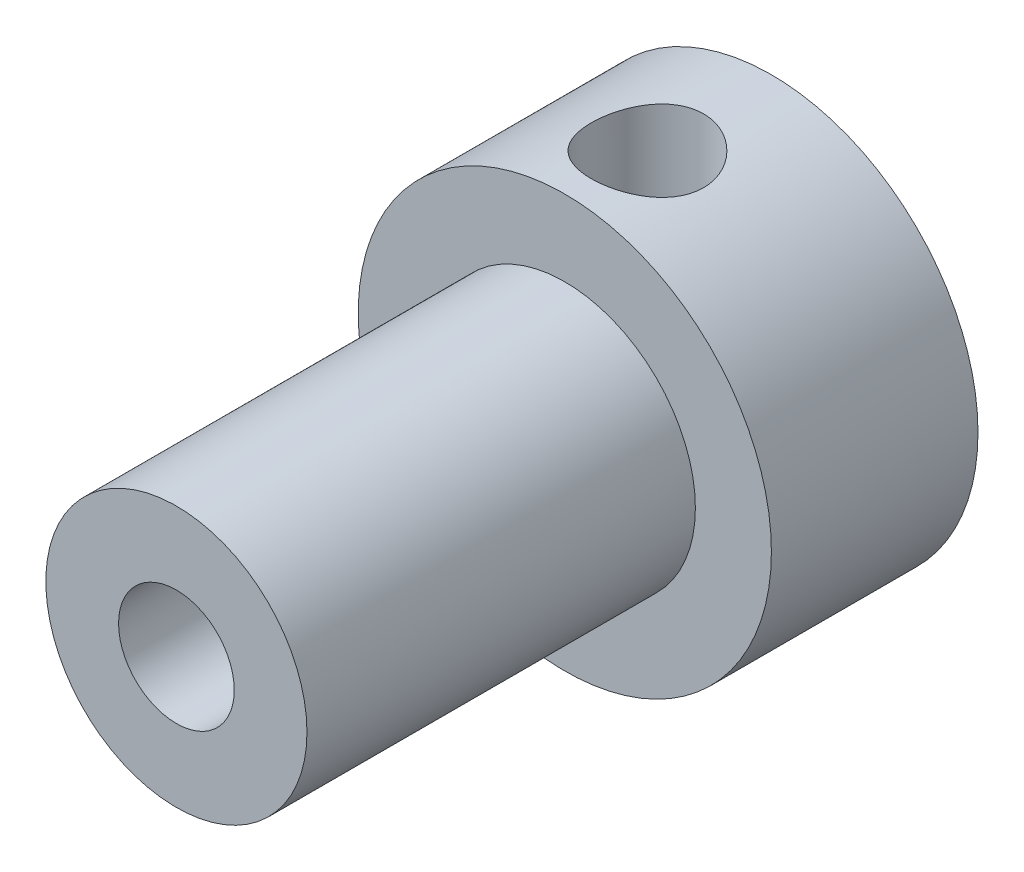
from build123d import *

# Parameters (mm, degrees)
SKETCH1_R                  = 6.35
SKETCH1_R_2                = 1.778
EXTRUDE1_DEPTH             = 18.288
EXTRUDE2_START             = -11.938
SKETCH2_R                  = 6.35
SKETCH2_R_2                = 4.0132
EXTRUDE2_DEPTH             = 11.938
F_8_32_TAPPED_HOLE1_REACH  = 22.279
F_8_32_TAPPED_HOLE1_BORE_R = 1.7272
SKETCH4_R                  = 2.00025
EXTRUDE3_DEPTH             = 10.668


with BuildPart() as part:
    # Sketch1 → Extrude1 (new body)
    with BuildSketch(Plane.XY):
        Circle(SKETCH1_R)
        Circle(SKETCH1_R_2, mode=Mode.SUBTRACT)
    extrude(amount=EXTRUDE1_DEPTH)

    # Sketch2 → Extrude2 (cut)
    with BuildSketch(Plane.XY.offset(18.288).offset(EXTRUDE2_START)):
        Circle(SKETCH2_R)
        Circle(SKETCH2_R_2, mode=Mode.SUBTRACT)
    extrude(amount=EXTRUDE2_DEPTH, mode=Mode.SUBTRACT)

    # 8-32 Tapped Hole1 bore (on position points) → 8-32 Tapped Hole1 (cut, up to next)
    with BuildSketch(Plane(origin=(0, 6.35, 3.81), x_dir=(1, 0, 0), z_dir=(0, 1, 0)), mode=Mode.PRIVATE) as f_8_32_tapped_hole1_sk1:
        Circle(F_8_32_TAPPED_HOLE1_BORE_R)
    f_8_32_tapped_hole1_tool1 = extrude(f_8_32_tapped_hole1_sk1.sketch, amount=-F_8_32_TAPPED_HOLE1_REACH, mode=Mode.PRIVATE) & part.part
    add(f_8_32_tapped_hole1_tool1.solids().sort_by_distance((0, 6.35, 3.81))[0], mode=Mode.SUBTRACT)

    # Sketch4 → Extrude3 (cut)
    with BuildSketch(Plane(origin=(0, 0, 0), x_dir=(-1, 0, 0), z_dir=(0, 0, -1))):
        Circle(SKETCH4_R)
    extrude(amount=-EXTRUDE3_DEPTH, mode=Mode.SUBTRACT)


solid = part.part
